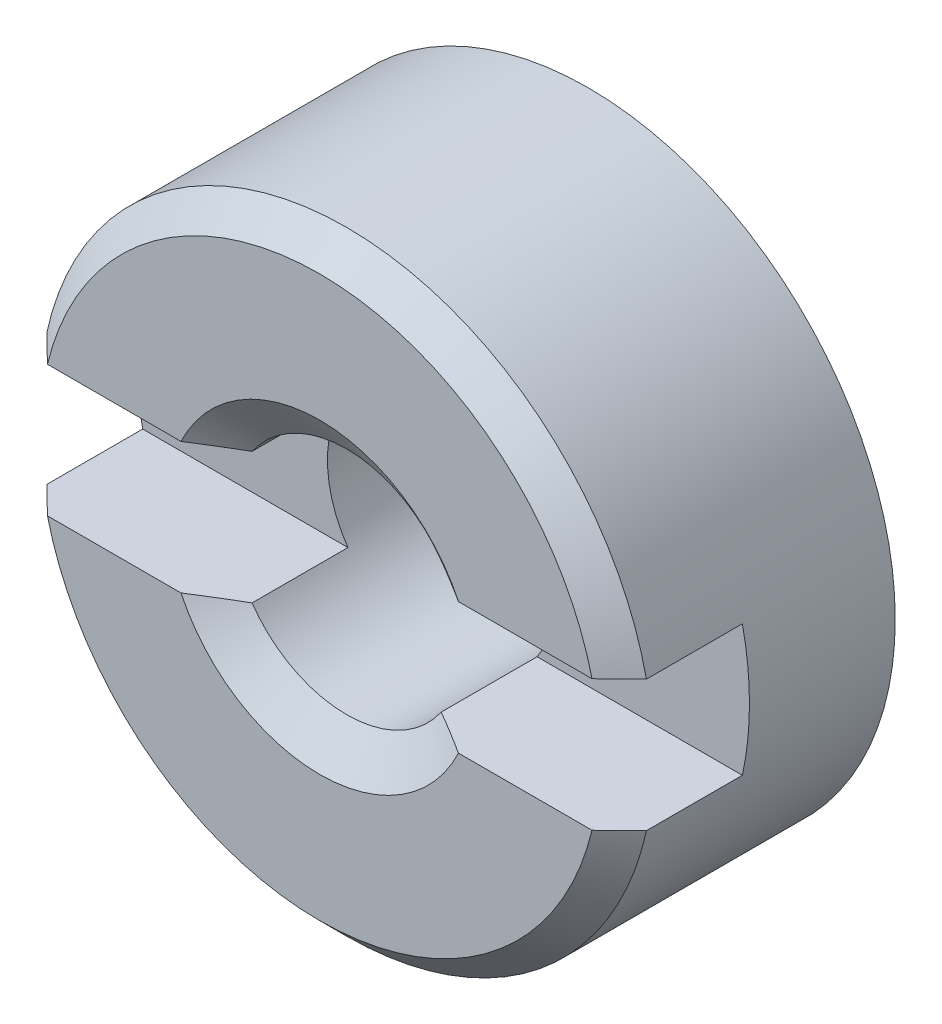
from build123d import *

# Parameters (mm, degrees)
BASENUTSKE_R            = 4
BASENUTSKE_R_2          = 1.5
BASENUT_DEPTH           = 3.5
CHAMFER1_SIZE           = 0.35
CUT_EXTRUDE1_DEPTH      = 7.652067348
CUT_EXTRUDE1_DEPTH_BACK = 7.652067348
SLOTSKE_W               = 1.6
SLOTSKE_H               = 1.71


with BuildPart() as part:
    # BaseNutSke → BaseNut (new body)
    with BuildSketch(Plane.XY):
        Circle(BASENUTSKE_R)
        Circle(BASENUTSKE_R_2, mode=Mode.SUBTRACT)
    extrude(amount=-BASENUT_DEPTH)

    # EndChSke (on Right Plane) → EndChamfer (revolve, cut)
    with BuildSketch(Plane(origin=(0, 0, 0), x_dir=(0, 0, -1), z_dir=(1, 0, 0)), mode=Mode.PRIVATE) as endchamfer_sk:
        Polygon((3.4746, 2), (3.089485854, 1.45), (3.5254, 1.45), (3.5254, 2), align=None)
        Polygon((-0.0508, 2), (0, 2), (0.385114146, 1.45), (-0.0508, 1.45), align=None)
    revolve(endchamfer_sk.sketch.rotate(Axis((0, 0, -25.037505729), (0, 0, -1)), 90), axis=Axis((0, 0, -25.037505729), (0, 0, -1)), mode=Mode.SUBTRACT)

    # Chamfer1
    chamfer1_edges = [part.edges().sort_by_distance(p)[0] for p in [
        (-4, 0, 0),
    ]]
    chamfer(chamfer1_edges, length=CHAMFER1_SIZE)

    # SlotSke → Cut-Extrude1 (cut, two sides: drawn at the far end of the back side and taken through both)
    with BuildSketch(Plane(origin=(0, 0, 0), x_dir=(0, 0, -1), z_dir=(1, 0, 0)).offset(-CUT_EXTRUDE1_DEPTH_BACK)):
        with Locations((0.8, 0)):
            Rectangle(SLOTSKE_W, SLOTSKE_H)
    extrude(amount=CUT_EXTRUDE1_DEPTH + CUT_EXTRUDE1_DEPTH_BACK, mode=Mode.SUBTRACT)


solid = part.part
